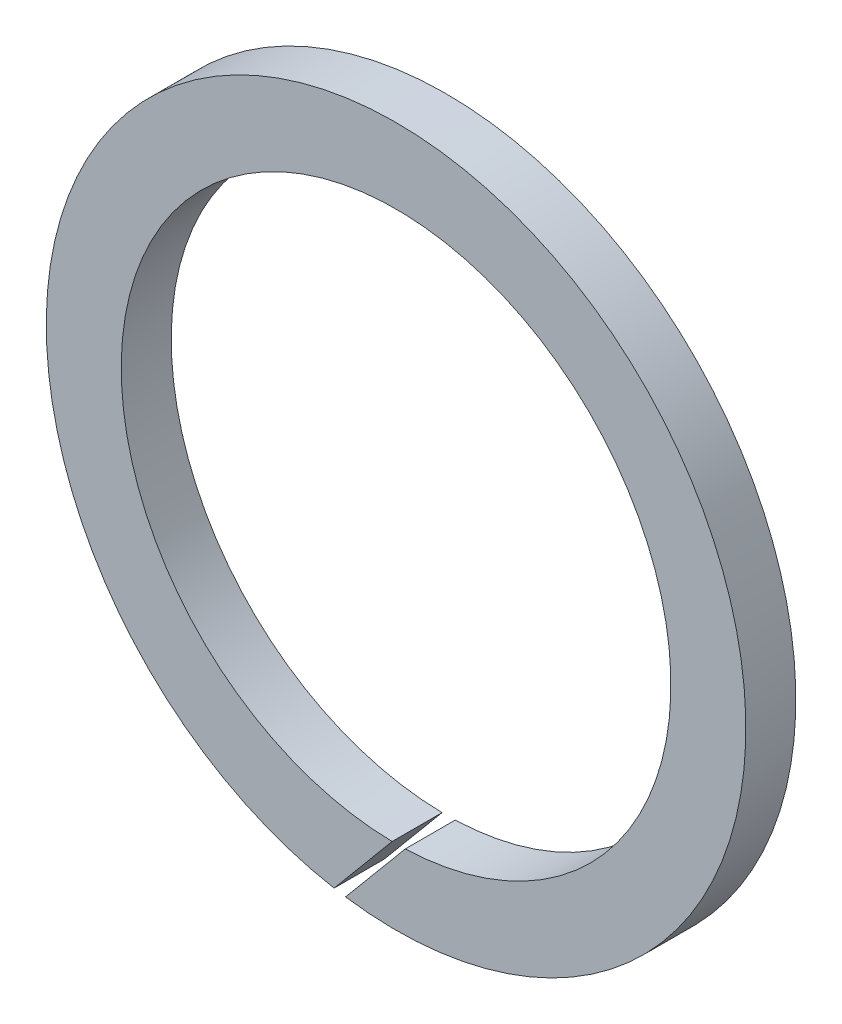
ISO-10303-21;
HEADER;
FILE_DESCRIPTION(('STEP AP214'),'2;1');
FILE_NAME('part.step','',(''),(''),'','','');
FILE_SCHEMA(('AUTOMOTIVE_DESIGN { 1 0 10303 214 1 1 1 1 }'));
ENDSEC;
DATA;
#1=APPLICATION_CONTEXT('core data for automotive mechanical design processes');
#2=APPLICATION_PROTOCOL_DEFINITION('international standard','automotive_design',2000,#1);
#3=PRODUCT_CONTEXT('',#1,'mechanical');
#4=PRODUCT('Part','Part','',(#3));
#5=PRODUCT_RELATED_PRODUCT_CATEGORY('part','',(#4));
#6=PRODUCT_DEFINITION_FORMATION('','',#4);
#7=PRODUCT_DEFINITION_CONTEXT('part definition',#1,'design');
#8=PRODUCT_DEFINITION('design','',#6,#7);
#9=PRODUCT_DEFINITION_SHAPE('','',#8);
#10=(LENGTH_UNIT() NAMED_UNIT(*) SI_UNIT(.MILLI.,.METRE.));
#11=(NAMED_UNIT(*) PLANE_ANGLE_UNIT() SI_UNIT($,.RADIAN.));
#12=(NAMED_UNIT(*) SI_UNIT($,.STERADIAN.) SOLID_ANGLE_UNIT());
#13=UNCERTAINTY_MEASURE_WITH_UNIT(LENGTH_MEASURE(1.E-05),#10,'distance_accuracy_value','');
#14=(GEOMETRIC_REPRESENTATION_CONTEXT(3) GLOBAL_UNCERTAINTY_ASSIGNED_CONTEXT((#13)) GLOBAL_UNIT_ASSIGNED_CONTEXT((#10,
#11,#12)) REPRESENTATION_CONTEXT('',''));
#15=CARTESIAN_POINT('',(0.,0.,0.));
#16=DIRECTION('',(0.,0.,1.));
#17=DIRECTION('',(1.,0.,0.));
#18=AXIS2_PLACEMENT_3D('',#15,#16,#17);
#19=CARTESIAN_POINT('',(0.,0.,1.));
#20=DIRECTION('',(0.,0.,1.));
#21=DIRECTION('',(1.,0.,0.));
#22=AXIS2_PLACEMENT_3D('',#19,#20,#21);
#23=PLANE('',#22);
#24=DIRECTION('',(0.641441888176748,0.767171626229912,0.));
#25=VECTOR('',#24,1.);
#26=CARTESIAN_POINT('',(-1.65820882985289,-7.70030902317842,1.));
#27=LINE('',#26,#25);
#28=CARTESIAN_POINT('',(-1.01127312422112,-6.92656673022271,1.));
#29=VERTEX_POINT('',#28);
#30=CARTESIAN_POINT('',(0.184073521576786,-5.49691885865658,1.));
#31=VERTEX_POINT('',#30);
#32=EDGE_CURVE('E61',#29,#31,#27,.T.);
#33=ORIENTED_EDGE('',*,*,#32,.F.);
#34=CARTESIAN_POINT('',(0.,0.,1.));
#35=DIRECTION('',(0.,0.,1.));
#36=DIRECTION('',(1.,0.,0.));
#37=AXIS2_PLACEMENT_3D('',#34,#35,#36);
#38=CIRCLE('',#37,7.);
#39=CARTESIAN_POINT('',(-1.24070270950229,-6.88916952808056,1.));
#40=VERTEX_POINT('',#39);
#41=EDGE_CURVE('E84',#29,#40,#38,.T.);
#42=ORIENTED_EDGE('',*,*,#41,.T.);
#43=DIRECTION('',(-0.641441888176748,-0.767171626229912,0.));
#44=VECTOR('',#43,1.);
#45=CARTESIAN_POINT('',(0.885109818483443,-4.34667412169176,1.));
#46=LINE('',#45,#44);
#47=CARTESIAN_POINT('',(-0.0787293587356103,-5.49943648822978,1.));
#48=VERTEX_POINT('',#47);
#49=EDGE_CURVE('E78',#48,#40,#46,.T.);
#50=ORIENTED_EDGE('',*,*,#49,.F.);
#51=CARTESIAN_POINT('',(0.,0.,1.));
#52=DIRECTION('',(0.,0.,1.));
#53=DIRECTION('',(1.,0.,0.));
#54=AXIS2_PLACEMENT_3D('',#51,#52,#53);
#55=CIRCLE('',#54,5.5);
#56=EDGE_CURVE('E88',#31,#48,#55,.T.);
#57=ORIENTED_EDGE('',*,*,#56,.F.);
#58=EDGE_LOOP('',(#33,#42,#50,#57));
#59=FACE_BOUND('',#58,.T.);
#60=ADVANCED_FACE('F39',(#59),#23,.T.);
#61=CARTESIAN_POINT('',(0.,0.,0.));
#62=DIRECTION('',(0.,0.,1.));
#63=DIRECTION('',(1.,0.,0.));
#64=AXIS2_PLACEMENT_3D('',#61,#62,#63);
#65=PLANE('',#64);
#66=CARTESIAN_POINT('',(0.,0.,0.));
#67=DIRECTION('',(0.,0.,1.));
#68=DIRECTION('',(1.,0.,0.));
#69=AXIS2_PLACEMENT_3D('',#66,#67,#68);
#70=CIRCLE('',#69,7.);
#71=CARTESIAN_POINT('',(-1.01127312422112,-6.92656673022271,0.));
#72=VERTEX_POINT('',#71);
#73=CARTESIAN_POINT('',(-1.24070270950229,-6.88916952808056,0.));
#74=VERTEX_POINT('',#73);
#75=EDGE_CURVE('E92',#72,#74,#70,.T.);
#76=ORIENTED_EDGE('',*,*,#75,.F.);
#77=DIRECTION('',(0.641441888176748,0.767171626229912,0.));
#78=VECTOR('',#77,1.);
#79=CARTESIAN_POINT('',(-1.65820882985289,-7.70030902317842,0.));
#80=LINE('',#79,#78);
#81=CARTESIAN_POINT('',(0.184073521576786,-5.49691885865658,0.));
#82=VERTEX_POINT('',#81);
#83=EDGE_CURVE('E105',#72,#82,#80,.T.);
#84=ORIENTED_EDGE('',*,*,#83,.T.);
#85=CARTESIAN_POINT('',(0.,0.,0.));
#86=DIRECTION('',(0.,0.,1.));
#87=DIRECTION('',(1.,0.,0.));
#88=AXIS2_PLACEMENT_3D('',#85,#86,#87);
#89=CIRCLE('',#88,5.5);
#90=CARTESIAN_POINT('',(-0.0787293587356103,-5.49943648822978,0.));
#91=VERTEX_POINT('',#90);
#92=EDGE_CURVE('E93',#82,#91,#89,.T.);
#93=ORIENTED_EDGE('',*,*,#92,.T.);
#94=DIRECTION('',(-0.641441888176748,-0.767171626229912,0.));
#95=VECTOR('',#94,1.);
#96=CARTESIAN_POINT('',(0.885109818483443,-4.34667412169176,0.));
#97=LINE('',#96,#95);
#98=EDGE_CURVE('E54',#91,#74,#97,.T.);
#99=ORIENTED_EDGE('',*,*,#98,.T.);
#100=EDGE_LOOP('',(#76,#84,#93,#99));
#101=FACE_BOUND('',#100,.T.);
#102=ADVANCED_FACE('F111',(#101),#65,.F.);
#103=CARTESIAN_POINT('',(0.,0.,1.));
#104=DIRECTION('',(0.,0.,-1.));
#105=DIRECTION('',(-1.,0.,0.));
#106=AXIS2_PLACEMENT_3D('',#103,#104,#105);
#107=CYLINDRICAL_SURFACE('',#106,7.);
#108=ORIENTED_EDGE('',*,*,#41,.F.);
#109=DIRECTION('',(0.,0.,-1.));
#110=VECTOR('',#109,1.);
#111=CARTESIAN_POINT('',(-1.01127312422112,-6.92656673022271,1.));
#112=LINE('',#111,#110);
#113=EDGE_CURVE('E97',#29,#72,#112,.T.);
#114=ORIENTED_EDGE('',*,*,#113,.T.);
#115=ORIENTED_EDGE('',*,*,#75,.T.);
#116=DIRECTION('',(0.,0.,-1.));
#117=VECTOR('',#116,1.);
#118=CARTESIAN_POINT('',(-1.24070270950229,-6.88916952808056,1.));
#119=LINE('',#118,#117);
#120=EDGE_CURVE('E103',#74,#40,#119,.F.);
#121=ORIENTED_EDGE('',*,*,#120,.T.);
#122=EDGE_LOOP('',(#108,#114,#115,#121));
#123=FACE_BOUND('',#122,.T.);
#124=ADVANCED_FACE('F41',(#123),#107,.T.);
#125=CARTESIAN_POINT('',(0.,0.,1.));
#126=DIRECTION('',(0.,0.,-1.));
#127=DIRECTION('',(-1.,0.,0.));
#128=AXIS2_PLACEMENT_3D('',#125,#126,#127);
#129=CYLINDRICAL_SURFACE('',#128,5.5);
#130=DIRECTION('',(0.,0.,-1.));
#131=VECTOR('',#130,1.);
#132=CARTESIAN_POINT('',(0.184073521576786,-5.49691885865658,1.));
#133=LINE('',#132,#131);
#134=EDGE_CURVE('E11',#31,#82,#133,.T.);
#135=ORIENTED_EDGE('',*,*,#134,.F.);
#136=ORIENTED_EDGE('',*,*,#56,.T.);
#137=DIRECTION('',(0.,0.,-1.));
#138=VECTOR('',#137,1.);
#139=CARTESIAN_POINT('',(-0.0787293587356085,-5.49943648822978,1.));
#140=LINE('',#139,#138);
#141=EDGE_CURVE('E47',#91,#48,#140,.F.);
#142=ORIENTED_EDGE('',*,*,#141,.F.);
#143=ORIENTED_EDGE('',*,*,#92,.F.);
#144=EDGE_LOOP('',(#135,#136,#142,#143));
#145=FACE_BOUND('',#144,.T.);
#146=ADVANCED_FACE('F91',(#145),#129,.F.);
#147=CARTESIAN_POINT('',(0.885109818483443,-4.34667412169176,0.));
#148=DIRECTION('',(-0.767171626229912,0.641441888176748,0.));
#149=DIRECTION('',(-0.641441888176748,-0.767171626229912,0.));
#150=AXIS2_PLACEMENT_3D('',#147,#148,#149);
#151=PLANE('',#150);
#152=ORIENTED_EDGE('',*,*,#98,.F.);
#153=ORIENTED_EDGE('',*,*,#141,.T.);
#154=ORIENTED_EDGE('',*,*,#49,.T.);
#155=ORIENTED_EDGE('',*,*,#120,.F.);
#156=EDGE_LOOP('',(#152,#153,#154,#155));
#157=FACE_BOUND('',#156,.T.);
#158=ADVANCED_FACE('F77',(#157),#151,.F.);
#159=CARTESIAN_POINT('',(-1.65820882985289,-7.70030902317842,0.));
#160=DIRECTION('',(0.767171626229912,-0.641441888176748,0.));
#161=DIRECTION('',(0.641441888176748,0.767171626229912,0.));
#162=AXIS2_PLACEMENT_3D('',#159,#160,#161);
#163=PLANE('',#162);
#164=ORIENTED_EDGE('',*,*,#32,.T.);
#165=ORIENTED_EDGE('',*,*,#134,.T.);
#166=ORIENTED_EDGE('',*,*,#83,.F.);
#167=ORIENTED_EDGE('',*,*,#113,.F.);
#168=EDGE_LOOP('',(#164,#165,#166,#167));
#169=FACE_BOUND('',#168,.T.);
#170=ADVANCED_FACE('F113',(#169),#163,.F.);
#171=CLOSED_SHELL('',(#60,#102,#124,#146,#158,#170));
#172=MANIFOLD_SOLID_BREP('B2',#171);
#173=ADVANCED_BREP_SHAPE_REPRESENTATION('',(#18,#172),#14);
#174=SHAPE_DEFINITION_REPRESENTATION(#9,#173);
ENDSEC;
END-ISO-10303-21;
